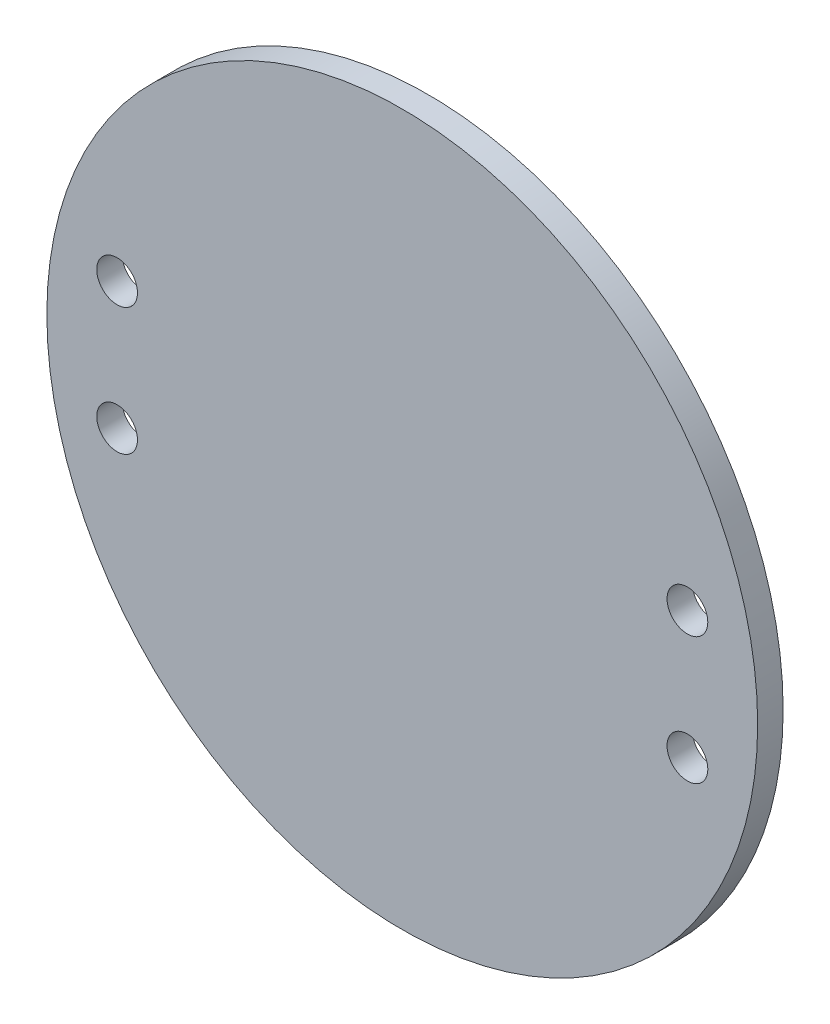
from build123d import *

# Parameters (mm, degrees)
SKETCH1_R      = 22.1615
SKETCH1_R_2    = 1.27
EXTRUDE1_DEPTH = 1.5875


with BuildPart() as part:
    # Sketch1 → Extrude1 (new body)
    with BuildSketch(Plane.XY):
        Circle(SKETCH1_R)
        with Locations((-17.78, 3.96875)):
            Circle(SKETCH1_R_2, mode=Mode.SUBTRACT)
        with Locations((17.78, 3.96875)):
            Circle(SKETCH1_R_2, mode=Mode.SUBTRACT)
        with Locations(Location((17.78, -3.96875, 0), (0, 0, 180))):
            Circle(SKETCH1_R_2, mode=Mode.SUBTRACT)
        with Locations(Location((-17.78, -3.96875, 0), (0, 0, 180))):
            Circle(SKETCH1_R_2, mode=Mode.SUBTRACT)
    extrude(amount=EXTRUDE1_DEPTH)


solid = part.part
